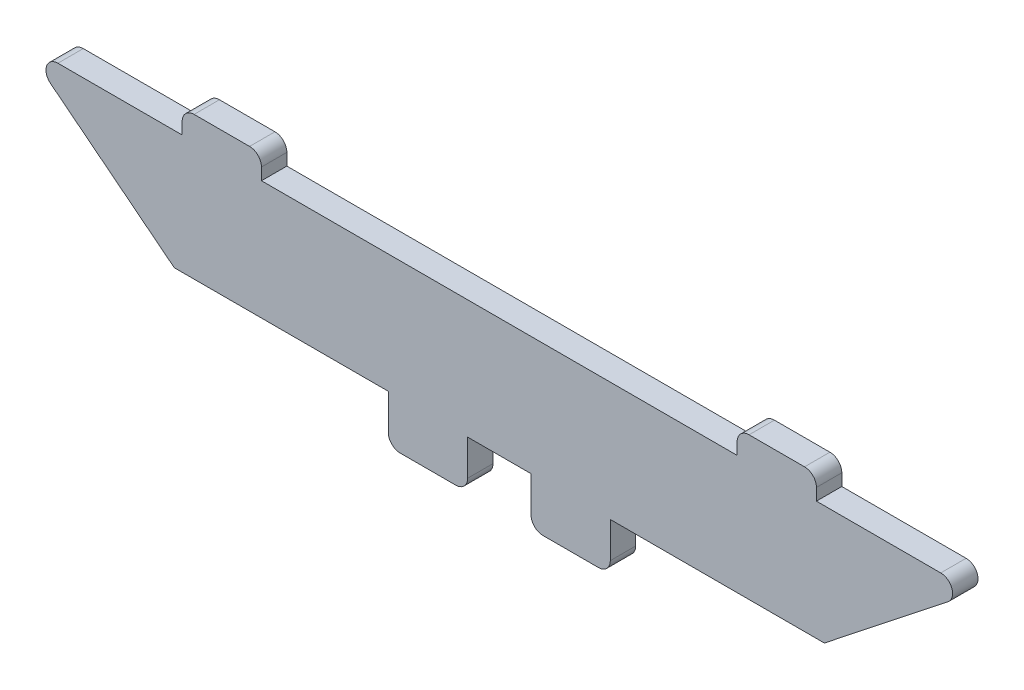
ISO-10303-21;
HEADER;
FILE_DESCRIPTION(('STEP AP214'),'2;1');
FILE_NAME('part.step','',(''),(''),'','','');
FILE_SCHEMA(('AUTOMOTIVE_DESIGN { 1 0 10303 214 1 1 1 1 }'));
ENDSEC;
DATA;
#1=APPLICATION_CONTEXT('core data for automotive mechanical design processes');
#2=APPLICATION_PROTOCOL_DEFINITION('international standard','automotive_design',2000,#1);
#3=PRODUCT_CONTEXT('',#1,'mechanical');
#4=PRODUCT('Part','Part','',(#3));
#5=PRODUCT_RELATED_PRODUCT_CATEGORY('part','',(#4));
#6=PRODUCT_DEFINITION_FORMATION('','',#4);
#7=PRODUCT_DEFINITION_CONTEXT('part definition',#1,'design');
#8=PRODUCT_DEFINITION('design','',#6,#7);
#9=PRODUCT_DEFINITION_SHAPE('','',#8);
#10=(LENGTH_UNIT() NAMED_UNIT(*) SI_UNIT(.MILLI.,.METRE.));
#11=(NAMED_UNIT(*) PLANE_ANGLE_UNIT() SI_UNIT($,.RADIAN.));
#12=(NAMED_UNIT(*) SI_UNIT($,.STERADIAN.) SOLID_ANGLE_UNIT());
#13=UNCERTAINTY_MEASURE_WITH_UNIT(LENGTH_MEASURE(1.E-05),#10,'distance_accuracy_value','');
#14=(GEOMETRIC_REPRESENTATION_CONTEXT(3) GLOBAL_UNCERTAINTY_ASSIGNED_CONTEXT((#13)) GLOBAL_UNIT_ASSIGNED_CONTEXT((#10,
#11,#12)) REPRESENTATION_CONTEXT('',''));
#15=CARTESIAN_POINT('',(0.,0.,0.));
#16=DIRECTION('',(0.,0.,1.));
#17=DIRECTION('',(1.,0.,0.));
#18=AXIS2_PLACEMENT_3D('',#15,#16,#17);
#19=CARTESIAN_POINT('',(-41.,0.,3.2));
#20=DIRECTION('',(0.619644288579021,0.784882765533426,0.));
#21=DIRECTION('',(-0.784882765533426,0.619644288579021,0.));
#22=AXIS2_PLACEMENT_3D('',#19,#20,#21);
#23=PLANE('',#22);
#24=DIRECTION('',(0.784882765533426,-0.619644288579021,0.));
#25=VECTOR('',#24,1.);
#26=CARTESIAN_POINT('',(-41.,0.,3.2));
#27=LINE('',#26,#25);
#28=CARTESIAN_POINT('',(-56.6087227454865,12.3226758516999,3.2));
#29=VERTEX_POINT('',#28);
#30=CARTESIAN_POINT('',(-41.,0.,3.2));
#31=VERTEX_POINT('',#30);
#32=EDGE_CURVE('E228',#29,#31,#27,.T.);
#33=ORIENTED_EDGE('',*,*,#32,.F.);
#34=DIRECTION('',(0.,0.,-1.));
#35=VECTOR('',#34,1.);
#36=CARTESIAN_POINT('',(-56.6087227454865,12.3226758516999,3.2));
#37=LINE('',#36,#35);
#38=CARTESIAN_POINT('',(-56.6087227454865,12.3226758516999,0.));
#39=VERTEX_POINT('',#38);
#40=EDGE_CURVE('E332',#29,#39,#37,.T.);
#41=ORIENTED_EDGE('',*,*,#40,.T.);
#42=DIRECTION('',(0.784882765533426,-0.619644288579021,0.));
#43=VECTOR('',#42,1.);
#44=CARTESIAN_POINT('',(-41.,0.,0.));
#45=LINE('',#44,#43);
#46=CARTESIAN_POINT('',(-41.,0.,0.));
#47=VERTEX_POINT('',#46);
#48=EDGE_CURVE('E253',#39,#47,#45,.T.);
#49=ORIENTED_EDGE('',*,*,#48,.T.);
#50=DIRECTION('',(0.,0.,-1.));
#51=VECTOR('',#50,1.);
#52=CARTESIAN_POINT('',(-41.,0.,3.2));
#53=LINE('',#52,#51);
#54=EDGE_CURVE('E246',#31,#47,#53,.T.);
#55=ORIENTED_EDGE('',*,*,#54,.F.);
#56=EDGE_LOOP('',(#33,#41,#49,#55));
#57=FACE_BOUND('',#56,.T.);
#58=ADVANCED_FACE('F33',(#57),#23,.F.);
#59=CARTESIAN_POINT('',(-41.,0.,3.2));
#60=DIRECTION('',(0.,1.,0.));
#61=DIRECTION('',(0.,0.,1.));
#62=AXIS2_PLACEMENT_3D('',#59,#60,#61);
#63=PLANE('',#62);
#64=DIRECTION('',(1.,0.,0.));
#65=VECTOR('',#64,1.);
#66=CARTESIAN_POINT('',(-41.,0.,0.));
#67=LINE('',#66,#65);
#68=CARTESIAN_POINT('',(-14.,0.,0.));
#69=VERTEX_POINT('',#68);
#70=EDGE_CURVE('E463',#47,#69,#67,.T.);
#71=ORIENTED_EDGE('',*,*,#70,.T.);
#72=DIRECTION('',(0.,0.,-1.));
#73=VECTOR('',#72,1.);
#74=CARTESIAN_POINT('',(-14.,0.,3.2));
#75=LINE('',#74,#73);
#76=CARTESIAN_POINT('',(-14.,0.,3.2));
#77=VERTEX_POINT('',#76);
#78=EDGE_CURVE('E248',#77,#69,#75,.T.);
#79=ORIENTED_EDGE('',*,*,#78,.F.);
#80=DIRECTION('',(1.,0.,0.));
#81=VECTOR('',#80,1.);
#82=CARTESIAN_POINT('',(-41.,0.,3.2));
#83=LINE('',#82,#81);
#84=EDGE_CURVE('E233',#31,#77,#83,.T.);
#85=ORIENTED_EDGE('',*,*,#84,.F.);
#86=ORIENTED_EDGE('',*,*,#54,.T.);
#87=EDGE_LOOP('',(#71,#79,#85,#86));
#88=FACE_BOUND('',#87,.T.);
#89=ADVANCED_FACE('F245',(#88),#63,.F.);
#90=CARTESIAN_POINT('',(-14.,0.,3.2));
#91=DIRECTION('',(1.,0.,0.));
#92=DIRECTION('',(0.,1.,0.));
#93=AXIS2_PLACEMENT_3D('',#90,#91,#92);
#94=PLANE('',#93);
#95=DIRECTION('',(0.,-1.,0.));
#96=VECTOR('',#95,1.);
#97=CARTESIAN_POINT('',(-14.,0.,0.));
#98=LINE('',#97,#96);
#99=CARTESIAN_POINT('',(-14.,-4.5,0.));
#100=VERTEX_POINT('',#99);
#101=EDGE_CURVE('E465',#69,#100,#98,.T.);
#102=ORIENTED_EDGE('',*,*,#101,.T.);
#103=DIRECTION('',(0.,0.,-1.));
#104=VECTOR('',#103,1.);
#105=CARTESIAN_POINT('',(-14.,-4.5,3.2));
#106=LINE('',#105,#104);
#107=CARTESIAN_POINT('',(-14.,-4.5,3.2));
#108=VERTEX_POINT('',#107);
#109=EDGE_CURVE('E330',#100,#108,#106,.F.);
#110=ORIENTED_EDGE('',*,*,#109,.T.);
#111=DIRECTION('',(0.,-1.,0.));
#112=VECTOR('',#111,1.);
#113=CARTESIAN_POINT('',(-14.,0.,3.2));
#114=LINE('',#113,#112);
#115=EDGE_CURVE('E250',#77,#108,#114,.T.);
#116=ORIENTED_EDGE('',*,*,#115,.F.);
#117=ORIENTED_EDGE('',*,*,#78,.T.);
#118=EDGE_LOOP('',(#102,#110,#116,#117));
#119=FACE_BOUND('',#118,.T.);
#120=ADVANCED_FACE('F523',(#119),#94,.F.);
#121=CARTESIAN_POINT('',(-14.,-6.,3.2));
#122=DIRECTION('',(0.,1.,0.));
#123=DIRECTION('',(0.,0.,1.));
#124=AXIS2_PLACEMENT_3D('',#121,#122,#123);
#125=PLANE('',#124);
#126=DIRECTION('',(1.,0.,0.));
#127=VECTOR('',#126,1.);
#128=CARTESIAN_POINT('',(-14.,-6.,0.));
#129=LINE('',#128,#127);
#130=CARTESIAN_POINT('',(-12.5,-6.,0.));
#131=VERTEX_POINT('',#130);
#132=CARTESIAN_POINT('',(-5.5,-6.,0.));
#133=VERTEX_POINT('',#132);
#134=EDGE_CURVE('E420',#131,#133,#129,.T.);
#135=ORIENTED_EDGE('',*,*,#134,.T.);
#136=DIRECTION('',(0.,0.,-1.));
#137=VECTOR('',#136,1.);
#138=CARTESIAN_POINT('',(-5.5,-6.,3.2));
#139=LINE('',#138,#137);
#140=CARTESIAN_POINT('',(-5.5,-6.,3.2));
#141=VERTEX_POINT('',#140);
#142=EDGE_CURVE('E328',#133,#141,#139,.F.);
#143=ORIENTED_EDGE('',*,*,#142,.T.);
#144=DIRECTION('',(1.,0.,0.));
#145=VECTOR('',#144,1.);
#146=CARTESIAN_POINT('',(-14.,-6.,3.2));
#147=LINE('',#146,#145);
#148=CARTESIAN_POINT('',(-12.5,-6.,3.2));
#149=VERTEX_POINT('',#148);
#150=EDGE_CURVE('E480',#149,#141,#147,.T.);
#151=ORIENTED_EDGE('',*,*,#150,.F.);
#152=DIRECTION('',(0.,0.,-1.));
#153=VECTOR('',#152,1.);
#154=CARTESIAN_POINT('',(-12.5,-6.,3.2));
#155=LINE('',#154,#153);
#156=EDGE_CURVE('E325',#149,#131,#155,.T.);
#157=ORIENTED_EDGE('',*,*,#156,.T.);
#158=EDGE_LOOP('',(#135,#143,#151,#157));
#159=FACE_BOUND('',#158,.T.);
#160=ADVANCED_FACE('F471',(#159),#125,.F.);
#161=CARTESIAN_POINT('',(-4.,-6.,3.2));
#162=DIRECTION('',(-1.,0.,0.));
#163=DIRECTION('',(0.,0.,1.));
#164=AXIS2_PLACEMENT_3D('',#161,#162,#163);
#165=PLANE('',#164);
#166=DIRECTION('',(0.,1.,0.));
#167=VECTOR('',#166,1.);
#168=CARTESIAN_POINT('',(-4.,-6.,3.2));
#169=LINE('',#168,#167);
#170=CARTESIAN_POINT('',(-4.,-4.5,3.2));
#171=VERTEX_POINT('',#170);
#172=CARTESIAN_POINT('',(-4.,0.,3.2));
#173=VERTEX_POINT('',#172);
#174=EDGE_CURVE('E479',#171,#173,#169,.T.);
#175=ORIENTED_EDGE('',*,*,#174,.F.);
#176=DIRECTION('',(0.,0.,-1.));
#177=VECTOR('',#176,1.);
#178=CARTESIAN_POINT('',(-4.,-4.5,3.2));
#179=LINE('',#178,#177);
#180=CARTESIAN_POINT('',(-4.,-4.5,0.));
#181=VERTEX_POINT('',#180);
#182=EDGE_CURVE('E322',#171,#181,#179,.T.);
#183=ORIENTED_EDGE('',*,*,#182,.T.);
#184=DIRECTION('',(0.,1.,0.));
#185=VECTOR('',#184,1.);
#186=CARTESIAN_POINT('',(-4.,-6.,0.));
#187=LINE('',#186,#185);
#188=CARTESIAN_POINT('',(-4.,0.,0.));
#189=VERTEX_POINT('',#188);
#190=EDGE_CURVE('E414',#181,#189,#187,.T.);
#191=ORIENTED_EDGE('',*,*,#190,.T.);
#192=DIRECTION('',(0.,0.,-1.));
#193=VECTOR('',#192,1.);
#194=CARTESIAN_POINT('',(-4.,0.,3.2));
#195=LINE('',#194,#193);
#196=EDGE_CURVE('E260',#173,#189,#195,.T.);
#197=ORIENTED_EDGE('',*,*,#196,.F.);
#198=EDGE_LOOP('',(#175,#183,#191,#197));
#199=FACE_BOUND('',#198,.T.);
#200=ADVANCED_FACE('F481',(#199),#165,.F.);
#201=CARTESIAN_POINT('',(-4.,0.,3.2));
#202=DIRECTION('',(0.,1.,0.));
#203=DIRECTION('',(-1.,0.,0.));
#204=AXIS2_PLACEMENT_3D('',#201,#202,#203);
#205=PLANE('',#204);
#206=DIRECTION('',(1.,0.,0.));
#207=VECTOR('',#206,1.);
#208=CARTESIAN_POINT('',(-4.,0.,0.));
#209=LINE('',#208,#207);
#210=CARTESIAN_POINT('',(4.,0.,0.));
#211=VERTEX_POINT('',#210);
#212=EDGE_CURVE('E408',#189,#211,#209,.T.);
#213=ORIENTED_EDGE('',*,*,#212,.T.);
#214=DIRECTION('',(0.,0.,-1.));
#215=VECTOR('',#214,1.);
#216=CARTESIAN_POINT('',(4.,0.,3.2));
#217=LINE('',#216,#215);
#218=CARTESIAN_POINT('',(4.,0.,3.2));
#219=VERTEX_POINT('',#218);
#220=EDGE_CURVE('E399',#219,#211,#217,.T.);
#221=ORIENTED_EDGE('',*,*,#220,.F.);
#222=DIRECTION('',(1.,0.,0.));
#223=VECTOR('',#222,1.);
#224=CARTESIAN_POINT('',(-4.,0.,3.2));
#225=LINE('',#224,#223);
#226=EDGE_CURVE('E409',#173,#219,#225,.T.);
#227=ORIENTED_EDGE('',*,*,#226,.F.);
#228=ORIENTED_EDGE('',*,*,#196,.T.);
#229=EDGE_LOOP('',(#213,#221,#227,#228));
#230=FACE_BOUND('',#229,.T.);
#231=ADVANCED_FACE('F406',(#230),#205,.F.);
#232=CARTESIAN_POINT('',(4.00000000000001,-6.,3.2));
#233=DIRECTION('',(1.,0.,0.));
#234=DIRECTION('',(0.,1.,0.));
#235=AXIS2_PLACEMENT_3D('',#232,#233,#234);
#236=PLANE('',#235);
#237=DIRECTION('',(0.,-1.,0.));
#238=VECTOR('',#237,1.);
#239=CARTESIAN_POINT('',(4.00000000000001,-6.,0.));
#240=LINE('',#239,#238);
#241=CARTESIAN_POINT('',(4.00000000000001,-4.5,0.));
#242=VERTEX_POINT('',#241);
#243=EDGE_CURVE('E416',#211,#242,#240,.T.);
#244=ORIENTED_EDGE('',*,*,#243,.T.);
#245=DIRECTION('',(0.,0.,-1.));
#246=VECTOR('',#245,1.);
#247=CARTESIAN_POINT('',(4.00000000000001,-4.5,3.2));
#248=LINE('',#247,#246);
#249=CARTESIAN_POINT('',(4.00000000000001,-4.5,3.2));
#250=VERTEX_POINT('',#249);
#251=EDGE_CURVE('E320',#242,#250,#248,.F.);
#252=ORIENTED_EDGE('',*,*,#251,.T.);
#253=DIRECTION('',(0.,-1.,0.));
#254=VECTOR('',#253,1.);
#255=CARTESIAN_POINT('',(4.00000000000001,-6.,3.2));
#256=LINE('',#255,#254);
#257=EDGE_CURVE('E483',#219,#250,#256,.T.);
#258=ORIENTED_EDGE('',*,*,#257,.F.);
#259=ORIENTED_EDGE('',*,*,#220,.T.);
#260=EDGE_LOOP('',(#244,#252,#258,#259));
#261=FACE_BOUND('',#260,.T.);
#262=ADVANCED_FACE('F703',(#261),#236,.F.);
#263=CARTESIAN_POINT('',(14.,-6.,3.2));
#264=DIRECTION('',(0.,1.,0.));
#265=DIRECTION('',(-1.,0.,0.));
#266=AXIS2_PLACEMENT_3D('',#263,#264,#265);
#267=PLANE('',#266);
#268=DIRECTION('',(1.,0.,0.));
#269=VECTOR('',#268,1.);
#270=CARTESIAN_POINT('',(14.,-6.,0.));
#271=LINE('',#270,#269);
#272=CARTESIAN_POINT('',(5.50000000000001,-6.,0.));
#273=VERTEX_POINT('',#272);
#274=CARTESIAN_POINT('',(12.5,-6.,0.));
#275=VERTEX_POINT('',#274);
#276=EDGE_CURVE('E418',#273,#275,#271,.T.);
#277=ORIENTED_EDGE('',*,*,#276,.T.);
#278=DIRECTION('',(0.,0.,-1.));
#279=VECTOR('',#278,1.);
#280=CARTESIAN_POINT('',(12.5,-6.,3.2));
#281=LINE('',#280,#279);
#282=CARTESIAN_POINT('',(12.5,-6.,3.2));
#283=VERTEX_POINT('',#282);
#284=EDGE_CURVE('E318',#275,#283,#281,.F.);
#285=ORIENTED_EDGE('',*,*,#284,.T.);
#286=DIRECTION('',(1.,0.,0.));
#287=VECTOR('',#286,1.);
#288=CARTESIAN_POINT('',(14.,-6.,3.2));
#289=LINE('',#288,#287);
#290=CARTESIAN_POINT('',(5.50000000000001,-6.,3.2));
#291=VERTEX_POINT('',#290);
#292=EDGE_CURVE('E490',#291,#283,#289,.T.);
#293=ORIENTED_EDGE('',*,*,#292,.F.);
#294=DIRECTION('',(0.,0.,-1.));
#295=VECTOR('',#294,1.);
#296=CARTESIAN_POINT('',(5.50000000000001,-6.,3.2));
#297=LINE('',#296,#295);
#298=EDGE_CURVE('E315',#291,#273,#297,.T.);
#299=ORIENTED_EDGE('',*,*,#298,.T.);
#300=EDGE_LOOP('',(#277,#285,#293,#299));
#301=FACE_BOUND('',#300,.T.);
#302=ADVANCED_FACE('F501',(#301),#267,.F.);
#303=CARTESIAN_POINT('',(14.,0.,3.2));
#304=DIRECTION('',(-1.,0.,0.));
#305=DIRECTION('',(0.,-1.,0.));
#306=AXIS2_PLACEMENT_3D('',#303,#304,#305);
#307=PLANE('',#306);
#308=DIRECTION('',(0.,1.,0.));
#309=VECTOR('',#308,1.);
#310=CARTESIAN_POINT('',(14.,0.,3.2));
#311=LINE('',#310,#309);
#312=CARTESIAN_POINT('',(14.,-4.5,3.2));
#313=VERTEX_POINT('',#312);
#314=CARTESIAN_POINT('',(14.,0.,3.2));
#315=VERTEX_POINT('',#314);
#316=EDGE_CURVE('E440',#313,#315,#311,.T.);
#317=ORIENTED_EDGE('',*,*,#316,.F.);
#318=DIRECTION('',(0.,0.,-1.));
#319=VECTOR('',#318,1.);
#320=CARTESIAN_POINT('',(14.,-4.5,3.2));
#321=LINE('',#320,#319);
#322=CARTESIAN_POINT('',(14.,-4.5,0.));
#323=VERTEX_POINT('',#322);
#324=EDGE_CURVE('E312',#313,#323,#321,.T.);
#325=ORIENTED_EDGE('',*,*,#324,.T.);
#326=DIRECTION('',(0.,1.,0.));
#327=VECTOR('',#326,1.);
#328=CARTESIAN_POINT('',(14.,0.,0.));
#329=LINE('',#328,#327);
#330=CARTESIAN_POINT('',(14.,0.,0.));
#331=VERTEX_POINT('',#330);
#332=EDGE_CURVE('E426',#323,#331,#329,.T.);
#333=ORIENTED_EDGE('',*,*,#332,.T.);
#334=DIRECTION('',(0.,0.,-1.));
#335=VECTOR('',#334,1.);
#336=CARTESIAN_POINT('',(14.,0.,3.2));
#337=LINE('',#336,#335);
#338=EDGE_CURVE('E396',#315,#331,#337,.T.);
#339=ORIENTED_EDGE('',*,*,#338,.F.);
#340=EDGE_LOOP('',(#317,#325,#333,#339));
#341=FACE_BOUND('',#340,.T.);
#342=ADVANCED_FACE('F496',(#341),#307,.F.);
#343=CARTESIAN_POINT('',(41.,0.,3.2));
#344=DIRECTION('',(0.,1.,0.));
#345=DIRECTION('',(-1.,0.,0.));
#346=AXIS2_PLACEMENT_3D('',#343,#344,#345);
#347=PLANE('',#346);
#348=DIRECTION('',(1.,0.,0.));
#349=VECTOR('',#348,1.);
#350=CARTESIAN_POINT('',(41.,0.,0.));
#351=LINE('',#350,#349);
#352=CARTESIAN_POINT('',(41.,0.,0.));
#353=VERTEX_POINT('',#352);
#354=EDGE_CURVE('E361',#331,#353,#351,.T.);
#355=ORIENTED_EDGE('',*,*,#354,.T.);
#356=DIRECTION('',(0.,0.,-1.));
#357=VECTOR('',#356,1.);
#358=CARTESIAN_POINT('',(41.,0.,3.2));
#359=LINE('',#358,#357);
#360=CARTESIAN_POINT('',(41.,0.,3.2));
#361=VERTEX_POINT('',#360);
#362=EDGE_CURVE('E393',#361,#353,#359,.T.);
#363=ORIENTED_EDGE('',*,*,#362,.F.);
#364=DIRECTION('',(1.,0.,0.));
#365=VECTOR('',#364,1.);
#366=CARTESIAN_POINT('',(41.,0.,3.2));
#367=LINE('',#366,#365);
#368=EDGE_CURVE('E436',#315,#361,#367,.T.);
#369=ORIENTED_EDGE('',*,*,#368,.F.);
#370=ORIENTED_EDGE('',*,*,#338,.T.);
#371=EDGE_LOOP('',(#355,#363,#369,#370));
#372=FACE_BOUND('',#371,.T.);
#373=ADVANCED_FACE('F430',(#372),#347,.F.);
#374=CARTESIAN_POINT('',(41.,0.,3.2));
#375=DIRECTION('',(-0.619644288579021,0.784882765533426,0.));
#376=DIRECTION('',(-0.784882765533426,-0.619644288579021,0.));
#377=AXIS2_PLACEMENT_3D('',#374,#375,#376);
#378=PLANE('',#377);
#379=DIRECTION('',(0.784882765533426,0.619644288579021,0.));
#380=VECTOR('',#379,1.);
#381=CARTESIAN_POINT('',(41.,0.,0.));
#382=LINE('',#381,#380);
#383=CARTESIAN_POINT('',(56.6087227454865,12.3226758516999,0.));
#384=VERTEX_POINT('',#383);
#385=EDGE_CURVE('E357',#353,#384,#382,.T.);
#386=ORIENTED_EDGE('',*,*,#385,.T.);
#387=DIRECTION('',(0.,0.,-1.));
#388=VECTOR('',#387,1.);
#389=CARTESIAN_POINT('',(56.6087227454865,12.3226758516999,3.2));
#390=LINE('',#389,#388);
#391=CARTESIAN_POINT('',(56.6087227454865,12.3226758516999,3.2));
#392=VERTEX_POINT('',#391);
#393=EDGE_CURVE('E11',#384,#392,#390,.F.);
#394=ORIENTED_EDGE('',*,*,#393,.T.);
#395=DIRECTION('',(0.784882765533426,0.619644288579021,0.));
#396=VECTOR('',#395,1.);
#397=CARTESIAN_POINT('',(41.,0.,3.2));
#398=LINE('',#397,#396);
#399=EDGE_CURVE('E435',#361,#392,#398,.T.);
#400=ORIENTED_EDGE('',*,*,#399,.F.);
#401=ORIENTED_EDGE('',*,*,#362,.T.);
#402=EDGE_LOOP('',(#386,#394,#400,#401));
#403=FACE_BOUND('',#402,.T.);
#404=ADVANCED_FACE('F434',(#403),#378,.F.);
#405=CARTESIAN_POINT('',(60.,15.,3.2));
#406=DIRECTION('',(0.,-1.,0.));
#407=DIRECTION('',(1.,0.,0.));
#408=AXIS2_PLACEMENT_3D('',#405,#406,#407);
#409=PLANE('',#408);
#410=DIRECTION('',(-1.,0.,0.));
#411=VECTOR('',#410,1.);
#412=CARTESIAN_POINT('',(60.,15.,3.2));
#413=LINE('',#412,#411);
#414=CARTESIAN_POINT('',(55.679256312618,15.,3.2));
#415=VERTEX_POINT('',#414);
#416=CARTESIAN_POINT('',(40.,15.,3.2));
#417=VERTEX_POINT('',#416);
#418=EDGE_CURVE('E349',#415,#417,#413,.T.);
#419=ORIENTED_EDGE('',*,*,#418,.F.);
#420=DIRECTION('',(0.,0.,-1.));
#421=VECTOR('',#420,1.);
#422=CARTESIAN_POINT('',(55.679256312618,15.,3.2));
#423=LINE('',#422,#421);
#424=CARTESIAN_POINT('',(55.679256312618,15.,0.));
#425=VERTEX_POINT('',#424);
#426=EDGE_CURVE('E41',#415,#425,#423,.T.);
#427=ORIENTED_EDGE('',*,*,#426,.T.);
#428=DIRECTION('',(-1.,0.,0.));
#429=VECTOR('',#428,1.);
#430=CARTESIAN_POINT('',(60.,15.,0.));
#431=LINE('',#430,#429);
#432=CARTESIAN_POINT('',(40.,15.,0.));
#433=VERTEX_POINT('',#432);
#434=EDGE_CURVE('E347',#425,#433,#431,.T.);
#435=ORIENTED_EDGE('',*,*,#434,.T.);
#436=DIRECTION('',(0.,0.,-1.));
#437=VECTOR('',#436,1.);
#438=CARTESIAN_POINT('',(40.,15.,3.2));
#439=LINE('',#438,#437);
#440=EDGE_CURVE('E391',#417,#433,#439,.T.);
#441=ORIENTED_EDGE('',*,*,#440,.F.);
#442=EDGE_LOOP('',(#419,#427,#435,#441));
#443=FACE_BOUND('',#442,.T.);
#444=ADVANCED_FACE('F345',(#443),#409,.F.);
#445=CARTESIAN_POINT('',(40.,15.,3.2));
#446=DIRECTION('',(-1.,0.,0.));
#447=DIRECTION('',(0.,0.,1.));
#448=AXIS2_PLACEMENT_3D('',#445,#446,#447);
#449=PLANE('',#448);
#450=DIRECTION('',(0.,1.,0.));
#451=VECTOR('',#450,1.);
#452=CARTESIAN_POINT('',(40.,15.,0.));
#453=LINE('',#452,#451);
#454=CARTESIAN_POINT('',(40.,16.5,0.));
#455=VERTEX_POINT('',#454);
#456=EDGE_CURVE('E356',#433,#455,#453,.T.);
#457=ORIENTED_EDGE('',*,*,#456,.T.);
#458=DIRECTION('',(0.,0.,-1.));
#459=VECTOR('',#458,1.);
#460=CARTESIAN_POINT('',(40.,16.5,3.2));
#461=LINE('',#460,#459);
#462=CARTESIAN_POINT('',(40.,16.5,3.2));
#463=VERTEX_POINT('',#462);
#464=EDGE_CURVE('E310',#455,#463,#461,.F.);
#465=ORIENTED_EDGE('',*,*,#464,.T.);
#466=DIRECTION('',(0.,1.,0.));
#467=VECTOR('',#466,1.);
#468=CARTESIAN_POINT('',(40.,15.,3.2));
#469=LINE('',#468,#467);
#470=EDGE_CURVE('E438',#417,#463,#469,.T.);
#471=ORIENTED_EDGE('',*,*,#470,.F.);
#472=ORIENTED_EDGE('',*,*,#440,.T.);
#473=EDGE_LOOP('',(#457,#465,#471,#472));
#474=FACE_BOUND('',#473,.T.);
#475=ADVANCED_FACE('F672',(#474),#449,.F.);
#476=CARTESIAN_POINT('',(40.,18.,3.2));
#477=DIRECTION('',(0.,-1.,0.));
#478=DIRECTION('',(1.,0.,0.));
#479=AXIS2_PLACEMENT_3D('',#476,#477,#478);
#480=PLANE('',#479);
#481=DIRECTION('',(-1.,0.,0.));
#482=VECTOR('',#481,1.);
#483=CARTESIAN_POINT('',(40.,18.,0.));
#484=LINE('',#483,#482);
#485=CARTESIAN_POINT('',(38.5,18.,0.));
#486=VERTEX_POINT('',#485);
#487=CARTESIAN_POINT('',(31.5,18.,0.));
#488=VERTEX_POINT('',#487);
#489=EDGE_CURVE('E359',#486,#488,#484,.T.);
#490=ORIENTED_EDGE('',*,*,#489,.T.);
#491=DIRECTION('',(0.,0.,-1.));
#492=VECTOR('',#491,1.);
#493=CARTESIAN_POINT('',(31.5,18.,3.2));
#494=LINE('',#493,#492);
#495=CARTESIAN_POINT('',(31.5,18.,3.2));
#496=VERTEX_POINT('',#495);
#497=EDGE_CURVE('E308',#488,#496,#494,.F.);
#498=ORIENTED_EDGE('',*,*,#497,.T.);
#499=DIRECTION('',(-1.,0.,0.));
#500=VECTOR('',#499,1.);
#501=CARTESIAN_POINT('',(40.,18.,3.2));
#502=LINE('',#501,#500);
#503=CARTESIAN_POINT('',(38.5,18.,3.2));
#504=VERTEX_POINT('',#503);
#505=EDGE_CURVE('E446',#504,#496,#502,.T.);
#506=ORIENTED_EDGE('',*,*,#505,.F.);
#507=DIRECTION('',(0.,0.,-1.));
#508=VECTOR('',#507,1.);
#509=CARTESIAN_POINT('',(38.5,18.,3.2));
#510=LINE('',#509,#508);
#511=EDGE_CURVE('E305',#504,#486,#510,.T.);
#512=ORIENTED_EDGE('',*,*,#511,.T.);
#513=EDGE_LOOP('',(#490,#498,#506,#512));
#514=FACE_BOUND('',#513,.T.);
#515=ADVANCED_FACE('F663',(#514),#480,.F.);
#516=CARTESIAN_POINT('',(30.,18.,3.2));
#517=DIRECTION('',(1.,0.,0.));
#518=DIRECTION('',(0.,0.,-1.));
#519=AXIS2_PLACEMENT_3D('',#516,#517,#518);
#520=PLANE('',#519);
#521=DIRECTION('',(0.,-1.,0.));
#522=VECTOR('',#521,1.);
#523=CARTESIAN_POINT('',(30.,18.,3.2));
#524=LINE('',#523,#522);
#525=CARTESIAN_POINT('',(30.,16.5,3.2));
#526=VERTEX_POINT('',#525);
#527=CARTESIAN_POINT('',(30.,15.,3.2));
#528=VERTEX_POINT('',#527);
#529=EDGE_CURVE('E449',#526,#528,#524,.T.);
#530=ORIENTED_EDGE('',*,*,#529,.F.);
#531=DIRECTION('',(0.,0.,-1.));
#532=VECTOR('',#531,1.);
#533=CARTESIAN_POINT('',(30.,16.5,3.2));
#534=LINE('',#533,#532);
#535=CARTESIAN_POINT('',(30.,16.5,0.));
#536=VERTEX_POINT('',#535);
#537=EDGE_CURVE('E302',#526,#536,#534,.T.);
#538=ORIENTED_EDGE('',*,*,#537,.T.);
#539=DIRECTION('',(0.,-1.,0.));
#540=VECTOR('',#539,1.);
#541=CARTESIAN_POINT('',(30.,18.,0.));
#542=LINE('',#541,#540);
#543=CARTESIAN_POINT('',(30.,15.,0.));
#544=VERTEX_POINT('',#543);
#545=EDGE_CURVE('E367',#536,#544,#542,.T.);
#546=ORIENTED_EDGE('',*,*,#545,.T.);
#547=DIRECTION('',(0.,0.,-1.));
#548=VECTOR('',#547,1.);
#549=CARTESIAN_POINT('',(30.,15.,3.2));
#550=LINE('',#549,#548);
#551=EDGE_CURVE('E388',#528,#544,#550,.T.);
#552=ORIENTED_EDGE('',*,*,#551,.F.);
#553=EDGE_LOOP('',(#530,#538,#546,#552));
#554=FACE_BOUND('',#553,.T.);
#555=ADVANCED_FACE('F546',(#554),#520,.F.);
#556=CARTESIAN_POINT('',(-30.,15.,3.2));
#557=DIRECTION('',(0.,-1.,0.));
#558=DIRECTION('',(1.,0.,0.));
#559=AXIS2_PLACEMENT_3D('',#556,#557,#558);
#560=PLANE('',#559);
#561=DIRECTION('',(-1.,0.,0.));
#562=VECTOR('',#561,1.);
#563=CARTESIAN_POINT('',(-30.,15.,0.));
#564=LINE('',#563,#562);
#565=CARTESIAN_POINT('',(-30.,15.,0.));
#566=VERTEX_POINT('',#565);
#567=EDGE_CURVE('E369',#544,#566,#564,.T.);
#568=ORIENTED_EDGE('',*,*,#567,.T.);
#569=DIRECTION('',(0.,0.,-1.));
#570=VECTOR('',#569,1.);
#571=CARTESIAN_POINT('',(-30.,15.,3.2));
#572=LINE('',#571,#570);
#573=CARTESIAN_POINT('',(-30.,15.,3.2));
#574=VERTEX_POINT('',#573);
#575=EDGE_CURVE('E384',#574,#566,#572,.T.);
#576=ORIENTED_EDGE('',*,*,#575,.F.);
#577=DIRECTION('',(-1.,0.,0.));
#578=VECTOR('',#577,1.);
#579=CARTESIAN_POINT('',(-30.,15.,3.2));
#580=LINE('',#579,#578);
#581=EDGE_CURVE('E451',#528,#574,#580,.T.);
#582=ORIENTED_EDGE('',*,*,#581,.F.);
#583=ORIENTED_EDGE('',*,*,#551,.T.);
#584=EDGE_LOOP('',(#568,#576,#582,#583));
#585=FACE_BOUND('',#584,.T.);
#586=ADVANCED_FACE('F552',(#585),#560,.F.);
#587=CARTESIAN_POINT('',(-30.,18.,3.2));
#588=DIRECTION('',(-1.,0.,0.));
#589=DIRECTION('',(0.,0.,1.));
#590=AXIS2_PLACEMENT_3D('',#587,#588,#589);
#591=PLANE('',#590);
#592=DIRECTION('',(0.,1.,0.));
#593=VECTOR('',#592,1.);
#594=CARTESIAN_POINT('',(-30.,18.,0.));
#595=LINE('',#594,#593);
#596=CARTESIAN_POINT('',(-30.,16.5,0.));
#597=VERTEX_POINT('',#596);
#598=EDGE_CURVE('E371',#566,#597,#595,.T.);
#599=ORIENTED_EDGE('',*,*,#598,.T.);
#600=DIRECTION('',(0.,0.,-1.));
#601=VECTOR('',#600,1.);
#602=CARTESIAN_POINT('',(-30.,16.5,3.2));
#603=LINE('',#602,#601);
#604=CARTESIAN_POINT('',(-30.,16.5,3.2));
#605=VERTEX_POINT('',#604);
#606=EDGE_CURVE('E300',#597,#605,#603,.F.);
#607=ORIENTED_EDGE('',*,*,#606,.T.);
#608=DIRECTION('',(0.,1.,0.));
#609=VECTOR('',#608,1.);
#610=CARTESIAN_POINT('',(-30.,18.,3.2));
#611=LINE('',#610,#609);
#612=EDGE_CURVE('E453',#574,#605,#611,.T.);
#613=ORIENTED_EDGE('',*,*,#612,.F.);
#614=ORIENTED_EDGE('',*,*,#575,.T.);
#615=EDGE_LOOP('',(#599,#607,#613,#614));
#616=FACE_BOUND('',#615,.T.);
#617=ADVANCED_FACE('F644',(#616),#591,.F.);
#618=CARTESIAN_POINT('',(-40.,18.,3.2));
#619=DIRECTION('',(0.,-1.,0.));
#620=DIRECTION('',(0.,0.,-1.));
#621=AXIS2_PLACEMENT_3D('',#618,#619,#620);
#622=PLANE('',#621);
#623=DIRECTION('',(-1.,0.,0.));
#624=VECTOR('',#623,1.);
#625=CARTESIAN_POINT('',(-40.,18.,0.));
#626=LINE('',#625,#624);
#627=CARTESIAN_POINT('',(-31.5,18.,0.));
#628=VERTEX_POINT('',#627);
#629=CARTESIAN_POINT('',(-38.5,18.,0.));
#630=VERTEX_POINT('',#629);
#631=EDGE_CURVE('E374',#628,#630,#626,.T.);
#632=ORIENTED_EDGE('',*,*,#631,.T.);
#633=DIRECTION('',(0.,0.,-1.));
#634=VECTOR('',#633,1.);
#635=CARTESIAN_POINT('',(-38.5,18.,3.2));
#636=LINE('',#635,#634);
#637=CARTESIAN_POINT('',(-38.5,18.,3.2));
#638=VERTEX_POINT('',#637);
#639=EDGE_CURVE('E282',#630,#638,#636,.F.);
#640=ORIENTED_EDGE('',*,*,#639,.T.);
#641=DIRECTION('',(-1.,0.,0.));
#642=VECTOR('',#641,1.);
#643=CARTESIAN_POINT('',(-40.,18.,3.2));
#644=LINE('',#643,#642);
#645=CARTESIAN_POINT('',(-31.5,18.,3.2));
#646=VERTEX_POINT('',#645);
#647=EDGE_CURVE('E456',#646,#638,#644,.T.);
#648=ORIENTED_EDGE('',*,*,#647,.F.);
#649=DIRECTION('',(0.,0.,-1.));
#650=VECTOR('',#649,1.);
#651=CARTESIAN_POINT('',(-31.5,18.,3.2));
#652=LINE('',#651,#650);
#653=EDGE_CURVE('E279',#646,#628,#652,.T.);
#654=ORIENTED_EDGE('',*,*,#653,.T.);
#655=EDGE_LOOP('',(#632,#640,#648,#654));
#656=FACE_BOUND('',#655,.T.);
#657=ADVANCED_FACE('F561',(#656),#622,.F.);
#658=CARTESIAN_POINT('',(-40.,15.,3.2));
#659=DIRECTION('',(1.,0.,0.));
#660=DIRECTION('',(0.,0.,-1.));
#661=AXIS2_PLACEMENT_3D('',#658,#659,#660);
#662=PLANE('',#661);
#663=DIRECTION('',(0.,-1.,0.));
#664=VECTOR('',#663,1.);
#665=CARTESIAN_POINT('',(-40.,15.,3.2));
#666=LINE('',#665,#664);
#667=CARTESIAN_POINT('',(-40.,16.5,3.2));
#668=VERTEX_POINT('',#667);
#669=CARTESIAN_POINT('',(-40.,15.,3.2));
#670=VERTEX_POINT('',#669);
#671=EDGE_CURVE('E459',#668,#670,#666,.T.);
#672=ORIENTED_EDGE('',*,*,#671,.F.);
#673=DIRECTION('',(0.,0.,-1.));
#674=VECTOR('',#673,1.);
#675=CARTESIAN_POINT('',(-40.,16.5,3.2));
#676=LINE('',#675,#674);
#677=CARTESIAN_POINT('',(-40.,16.5,0.));
#678=VERTEX_POINT('',#677);
#679=EDGE_CURVE('E255',#668,#678,#676,.T.);
#680=ORIENTED_EDGE('',*,*,#679,.T.);
#681=DIRECTION('',(0.,-1.,0.));
#682=VECTOR('',#681,1.);
#683=CARTESIAN_POINT('',(-40.,15.,0.));
#684=LINE('',#683,#682);
#685=CARTESIAN_POINT('',(-40.,15.,0.));
#686=VERTEX_POINT('',#685);
#687=EDGE_CURVE('E377',#678,#686,#684,.T.);
#688=ORIENTED_EDGE('',*,*,#687,.T.);
#689=DIRECTION('',(0.,0.,-1.));
#690=VECTOR('',#689,1.);
#691=CARTESIAN_POINT('',(-40.,15.,3.2));
#692=LINE('',#691,#690);
#693=EDGE_CURVE('E381',#670,#686,#692,.T.);
#694=ORIENTED_EDGE('',*,*,#693,.F.);
#695=EDGE_LOOP('',(#672,#680,#688,#694));
#696=FACE_BOUND('',#695,.T.);
#697=ADVANCED_FACE('F570',(#696),#662,.F.);
#698=CARTESIAN_POINT('',(-60.,15.,3.2));
#699=DIRECTION('',(0.,-1.,0.));
#700=DIRECTION('',(0.,0.,-1.));
#701=AXIS2_PLACEMENT_3D('',#698,#699,#700);
#702=PLANE('',#701);
#703=DIRECTION('',(-1.,0.,0.));
#704=VECTOR('',#703,1.);
#705=CARTESIAN_POINT('',(-60.,15.,0.));
#706=LINE('',#705,#704);
#707=CARTESIAN_POINT('',(-55.679256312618,15.,0.));
#708=VERTEX_POINT('',#707);
#709=EDGE_CURVE('E241',#686,#708,#706,.T.);
#710=ORIENTED_EDGE('',*,*,#709,.T.);
#711=DIRECTION('',(0.,0.,-1.));
#712=VECTOR('',#711,1.);
#713=CARTESIAN_POINT('',(-55.679256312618,15.,3.2));
#714=LINE('',#713,#712);
#715=CARTESIAN_POINT('',(-55.679256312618,15.,3.2));
#716=VERTEX_POINT('',#715);
#717=EDGE_CURVE('E338',#708,#716,#714,.F.);
#718=ORIENTED_EDGE('',*,*,#717,.T.);
#719=DIRECTION('',(-1.,0.,0.));
#720=VECTOR('',#719,1.);
#721=CARTESIAN_POINT('',(-60.,15.,3.2));
#722=LINE('',#721,#720);
#723=EDGE_CURVE('E385',#670,#716,#722,.T.);
#724=ORIENTED_EDGE('',*,*,#723,.F.);
#725=ORIENTED_EDGE('',*,*,#693,.T.);
#726=EDGE_LOOP('',(#710,#718,#724,#725));
#727=FACE_BOUND('',#726,.T.);
#728=ADVANCED_FACE('F633',(#727),#702,.F.);
#729=CARTESIAN_POINT('',(0.,0.,3.2));
#730=DIRECTION('',(0.,0.,-1.));
#731=DIRECTION('',(-1.,0.,0.));
#732=AXIS2_PLACEMENT_3D('',#729,#730,#731);
#733=PLANE('',#732);
#734=ORIENTED_EDGE('',*,*,#723,.T.);
#735=CARTESIAN_POINT('',(-55.679256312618,13.5,3.2));
#736=DIRECTION('',(0.,0.,-1.));
#737=DIRECTION('',(-1.,0.,0.));
#738=AXIS2_PLACEMENT_3D('',#735,#736,#737);
#739=CIRCLE('',#738,1.5);
#740=EDGE_CURVE('E236',#716,#29,#739,.F.);
#741=ORIENTED_EDGE('',*,*,#740,.T.);
#742=ORIENTED_EDGE('',*,*,#32,.T.);
#743=ORIENTED_EDGE('',*,*,#84,.T.);
#744=ORIENTED_EDGE('',*,*,#115,.T.);
#745=CARTESIAN_POINT('',(-12.5,-4.5,3.2));
#746=DIRECTION('',(0.,0.,-1.));
#747=DIRECTION('',(-1.,0.,0.));
#748=AXIS2_PLACEMENT_3D('',#745,#746,#747);
#749=CIRCLE('',#748,1.5);
#750=EDGE_CURVE('E284',#108,#149,#749,.F.);
#751=ORIENTED_EDGE('',*,*,#750,.T.);
#752=ORIENTED_EDGE('',*,*,#150,.T.);
#753=CARTESIAN_POINT('',(-5.5,-4.5,3.2));
#754=DIRECTION('',(0.,0.,-1.));
#755=DIRECTION('',(-1.,0.,0.));
#756=AXIS2_PLACEMENT_3D('',#753,#754,#755);
#757=CIRCLE('',#756,1.5);
#758=EDGE_CURVE('E286',#141,#171,#757,.F.);
#759=ORIENTED_EDGE('',*,*,#758,.T.);
#760=ORIENTED_EDGE('',*,*,#174,.T.);
#761=ORIENTED_EDGE('',*,*,#226,.T.);
#762=ORIENTED_EDGE('',*,*,#257,.T.);
#763=CARTESIAN_POINT('',(5.50000000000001,-4.5,3.2));
#764=DIRECTION('',(0.,0.,-1.));
#765=DIRECTION('',(-1.,0.,0.));
#766=AXIS2_PLACEMENT_3D('',#763,#764,#765);
#767=CIRCLE('',#766,1.5);
#768=EDGE_CURVE('E288',#250,#291,#767,.F.);
#769=ORIENTED_EDGE('',*,*,#768,.T.);
#770=ORIENTED_EDGE('',*,*,#292,.T.);
#771=CARTESIAN_POINT('',(12.5,-4.5,3.2));
#772=DIRECTION('',(0.,0.,-1.));
#773=DIRECTION('',(-1.,0.,0.));
#774=AXIS2_PLACEMENT_3D('',#771,#772,#773);
#775=CIRCLE('',#774,1.5);
#776=EDGE_CURVE('E290',#283,#313,#775,.F.);
#777=ORIENTED_EDGE('',*,*,#776,.T.);
#778=ORIENTED_EDGE('',*,*,#316,.T.);
#779=ORIENTED_EDGE('',*,*,#368,.T.);
#780=ORIENTED_EDGE('',*,*,#399,.T.);
#781=CARTESIAN_POINT('',(55.679256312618,13.5,3.2));
#782=DIRECTION('',(0.,0.,-1.));
#783=DIRECTION('',(-1.,0.,0.));
#784=AXIS2_PLACEMENT_3D('',#781,#782,#783);
#785=CIRCLE('',#784,1.5);
#786=EDGE_CURVE('E48',#392,#415,#785,.F.);
#787=ORIENTED_EDGE('',*,*,#786,.T.);
#788=ORIENTED_EDGE('',*,*,#418,.T.);
#789=ORIENTED_EDGE('',*,*,#470,.T.);
#790=CARTESIAN_POINT('',(38.5,16.5,3.2));
#791=DIRECTION('',(0.,0.,-1.));
#792=DIRECTION('',(-1.,0.,0.));
#793=AXIS2_PLACEMENT_3D('',#790,#791,#792);
#794=CIRCLE('',#793,1.5);
#795=EDGE_CURVE('E292',#463,#504,#794,.F.);
#796=ORIENTED_EDGE('',*,*,#795,.T.);
#797=ORIENTED_EDGE('',*,*,#505,.T.);
#798=CARTESIAN_POINT('',(31.5,16.5,3.2));
#799=DIRECTION('',(0.,0.,-1.));
#800=DIRECTION('',(-1.,0.,0.));
#801=AXIS2_PLACEMENT_3D('',#798,#799,#800);
#802=CIRCLE('',#801,1.5);
#803=EDGE_CURVE('E294',#496,#526,#802,.F.);
#804=ORIENTED_EDGE('',*,*,#803,.T.);
#805=ORIENTED_EDGE('',*,*,#529,.T.);
#806=ORIENTED_EDGE('',*,*,#581,.T.);
#807=ORIENTED_EDGE('',*,*,#612,.T.);
#808=CARTESIAN_POINT('',(-31.5,16.5,3.2));
#809=DIRECTION('',(0.,0.,-1.));
#810=DIRECTION('',(-1.,0.,0.));
#811=AXIS2_PLACEMENT_3D('',#808,#809,#810);
#812=CIRCLE('',#811,1.5);
#813=EDGE_CURVE('E296',#605,#646,#812,.F.);
#814=ORIENTED_EDGE('',*,*,#813,.T.);
#815=ORIENTED_EDGE('',*,*,#647,.T.);
#816=CARTESIAN_POINT('',(-38.5,16.5,3.2));
#817=DIRECTION('',(0.,0.,-1.));
#818=DIRECTION('',(-1.,0.,0.));
#819=AXIS2_PLACEMENT_3D('',#816,#817,#818);
#820=CIRCLE('',#819,1.5);
#821=EDGE_CURVE('E298',#638,#668,#820,.F.);
#822=ORIENTED_EDGE('',*,*,#821,.T.);
#823=ORIENTED_EDGE('',*,*,#671,.T.);
#824=EDGE_LOOP('',(#734,#741,#742,#743,#744,#751,#752,#759,#760,#761,#762,#769,#770,#777,#778,
#779,#780,#787,#788,#789,#796,#797,#804,#805,#806,#807,#814,#815,#822,#823));
#825=FACE_BOUND('',#824,.T.);
#826=ADVANCED_FACE('F231',(#825),#733,.F.);
#827=CARTESIAN_POINT('',(0.,0.,0.));
#828=DIRECTION('',(0.,0.,-1.));
#829=DIRECTION('',(-1.,0.,0.));
#830=AXIS2_PLACEMENT_3D('',#827,#828,#829);
#831=PLANE('',#830);
#832=ORIENTED_EDGE('',*,*,#48,.F.);
#833=CARTESIAN_POINT('',(-55.679256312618,13.5,0.));
#834=DIRECTION('',(0.,0.,-1.));
#835=DIRECTION('',(-1.,0.,0.));
#836=AXIS2_PLACEMENT_3D('',#833,#834,#835);
#837=CIRCLE('',#836,1.5);
#838=EDGE_CURVE('E336',#39,#708,#837,.T.);
#839=ORIENTED_EDGE('',*,*,#838,.T.);
#840=ORIENTED_EDGE('',*,*,#709,.F.);
#841=ORIENTED_EDGE('',*,*,#687,.F.);
#842=CARTESIAN_POINT('',(-38.5,16.5,0.));
#843=DIRECTION('',(0.,0.,-1.));
#844=DIRECTION('',(-1.,0.,0.));
#845=AXIS2_PLACEMENT_3D('',#842,#843,#844);
#846=CIRCLE('',#845,1.5);
#847=EDGE_CURVE('E277',#678,#630,#846,.T.);
#848=ORIENTED_EDGE('',*,*,#847,.T.);
#849=ORIENTED_EDGE('',*,*,#631,.F.);
#850=CARTESIAN_POINT('',(-31.5,16.5,0.));
#851=DIRECTION('',(0.,0.,-1.));
#852=DIRECTION('',(-1.,0.,0.));
#853=AXIS2_PLACEMENT_3D('',#850,#851,#852);
#854=CIRCLE('',#853,1.5);
#855=EDGE_CURVE('E275',#628,#597,#854,.T.);
#856=ORIENTED_EDGE('',*,*,#855,.T.);
#857=ORIENTED_EDGE('',*,*,#598,.F.);
#858=ORIENTED_EDGE('',*,*,#567,.F.);
#859=ORIENTED_EDGE('',*,*,#545,.F.);
#860=CARTESIAN_POINT('',(31.5,16.5,0.));
#861=DIRECTION('',(0.,0.,-1.));
#862=DIRECTION('',(-1.,0.,0.));
#863=AXIS2_PLACEMENT_3D('',#860,#861,#862);
#864=CIRCLE('',#863,1.5);
#865=EDGE_CURVE('E273',#536,#488,#864,.T.);
#866=ORIENTED_EDGE('',*,*,#865,.T.);
#867=ORIENTED_EDGE('',*,*,#489,.F.);
#868=CARTESIAN_POINT('',(38.5,16.5,0.));
#869=DIRECTION('',(0.,0.,-1.));
#870=DIRECTION('',(-1.,0.,0.));
#871=AXIS2_PLACEMENT_3D('',#868,#869,#870);
#872=CIRCLE('',#871,1.5);
#873=EDGE_CURVE('E271',#486,#455,#872,.T.);
#874=ORIENTED_EDGE('',*,*,#873,.T.);
#875=ORIENTED_EDGE('',*,*,#456,.F.);
#876=ORIENTED_EDGE('',*,*,#434,.F.);
#877=CARTESIAN_POINT('',(55.679256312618,13.5,0.));
#878=DIRECTION('',(0.,0.,-1.));
#879=DIRECTION('',(-1.,0.,0.));
#880=AXIS2_PLACEMENT_3D('',#877,#878,#879);
#881=CIRCLE('',#880,1.5);
#882=EDGE_CURVE('E334',#425,#384,#881,.T.);
#883=ORIENTED_EDGE('',*,*,#882,.T.);
#884=ORIENTED_EDGE('',*,*,#385,.F.);
#885=ORIENTED_EDGE('',*,*,#354,.F.);
#886=ORIENTED_EDGE('',*,*,#332,.F.);
#887=CARTESIAN_POINT('',(12.5,-4.5,0.));
#888=DIRECTION('',(0.,0.,-1.));
#889=DIRECTION('',(-1.,0.,0.));
#890=AXIS2_PLACEMENT_3D('',#887,#888,#889);
#891=CIRCLE('',#890,1.5);
#892=EDGE_CURVE('E269',#323,#275,#891,.T.);
#893=ORIENTED_EDGE('',*,*,#892,.T.);
#894=ORIENTED_EDGE('',*,*,#276,.F.);
#895=CARTESIAN_POINT('',(5.50000000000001,-4.5,0.));
#896=DIRECTION('',(0.,0.,-1.));
#897=DIRECTION('',(-1.,0.,0.));
#898=AXIS2_PLACEMENT_3D('',#895,#896,#897);
#899=CIRCLE('',#898,1.5);
#900=EDGE_CURVE('E267',#273,#242,#899,.T.);
#901=ORIENTED_EDGE('',*,*,#900,.T.);
#902=ORIENTED_EDGE('',*,*,#243,.F.);
#903=ORIENTED_EDGE('',*,*,#212,.F.);
#904=ORIENTED_EDGE('',*,*,#190,.F.);
#905=CARTESIAN_POINT('',(-5.5,-4.5,0.));
#906=DIRECTION('',(0.,0.,-1.));
#907=DIRECTION('',(-1.,0.,0.));
#908=AXIS2_PLACEMENT_3D('',#905,#906,#907);
#909=CIRCLE('',#908,1.5);
#910=EDGE_CURVE('E265',#181,#133,#909,.T.);
#911=ORIENTED_EDGE('',*,*,#910,.T.);
#912=ORIENTED_EDGE('',*,*,#134,.F.);
#913=CARTESIAN_POINT('',(-12.5,-4.5,0.));
#914=DIRECTION('',(0.,0.,-1.));
#915=DIRECTION('',(-1.,0.,0.));
#916=AXIS2_PLACEMENT_3D('',#913,#914,#915);
#917=CIRCLE('',#916,1.5);
#918=EDGE_CURVE('E258',#131,#100,#917,.T.);
#919=ORIENTED_EDGE('',*,*,#918,.T.);
#920=ORIENTED_EDGE('',*,*,#101,.F.);
#921=ORIENTED_EDGE('',*,*,#70,.F.);
#922=EDGE_LOOP('',(#832,#839,#840,#841,#848,#849,#856,#857,#858,#859,#866,#867,#874,#875,#876,
#883,#884,#885,#886,#893,#894,#901,#902,#903,#904,#911,#912,#919,#920,#921));
#923=FACE_BOUND('',#922,.T.);
#924=ADVANCED_FACE('F353',(#923),#831,.T.);
#925=CARTESIAN_POINT('',(-38.5,16.5,3.2));
#926=DIRECTION('',(0.,0.,-1.));
#927=DIRECTION('',(-1.,0.,0.));
#928=AXIS2_PLACEMENT_3D('',#925,#926,#927);
#929=CYLINDRICAL_SURFACE('',#928,1.5);
#930=ORIENTED_EDGE('',*,*,#821,.F.);
#931=ORIENTED_EDGE('',*,*,#639,.F.);
#932=ORIENTED_EDGE('',*,*,#847,.F.);
#933=ORIENTED_EDGE('',*,*,#679,.F.);
#934=EDGE_LOOP('',(#930,#931,#932,#933));
#935=FACE_BOUND('',#934,.T.);
#936=ADVANCED_FACE('F527',(#935),#929,.T.);
#937=CARTESIAN_POINT('',(-31.5,16.5,3.2));
#938=DIRECTION('',(0.,0.,-1.));
#939=DIRECTION('',(-1.,0.,0.));
#940=AXIS2_PLACEMENT_3D('',#937,#938,#939);
#941=CYLINDRICAL_SURFACE('',#940,1.5);
#942=ORIENTED_EDGE('',*,*,#813,.F.);
#943=ORIENTED_EDGE('',*,*,#606,.F.);
#944=ORIENTED_EDGE('',*,*,#855,.F.);
#945=ORIENTED_EDGE('',*,*,#653,.F.);
#946=EDGE_LOOP('',(#942,#943,#944,#945));
#947=FACE_BOUND('',#946,.T.);
#948=ADVANCED_FACE('F530',(#947),#941,.T.);
#949=CARTESIAN_POINT('',(31.5,16.5,3.2));
#950=DIRECTION('',(0.,0.,-1.));
#951=DIRECTION('',(-1.,0.,0.));
#952=AXIS2_PLACEMENT_3D('',#949,#950,#951);
#953=CYLINDRICAL_SURFACE('',#952,1.5);
#954=ORIENTED_EDGE('',*,*,#803,.F.);
#955=ORIENTED_EDGE('',*,*,#497,.F.);
#956=ORIENTED_EDGE('',*,*,#865,.F.);
#957=ORIENTED_EDGE('',*,*,#537,.F.);
#958=EDGE_LOOP('',(#954,#955,#956,#957));
#959=FACE_BOUND('',#958,.T.);
#960=ADVANCED_FACE('F515',(#959),#953,.T.);
#961=CARTESIAN_POINT('',(38.5,16.5,3.2));
#962=DIRECTION('',(0.,0.,-1.));
#963=DIRECTION('',(-1.,0.,0.));
#964=AXIS2_PLACEMENT_3D('',#961,#962,#963);
#965=CYLINDRICAL_SURFACE('',#964,1.5);
#966=ORIENTED_EDGE('',*,*,#795,.F.);
#967=ORIENTED_EDGE('',*,*,#464,.F.);
#968=ORIENTED_EDGE('',*,*,#873,.F.);
#969=ORIENTED_EDGE('',*,*,#511,.F.);
#970=EDGE_LOOP('',(#966,#967,#968,#969));
#971=FACE_BOUND('',#970,.T.);
#972=ADVANCED_FACE('F507',(#971),#965,.T.);
#973=CARTESIAN_POINT('',(12.5,-4.5,3.2));
#974=DIRECTION('',(0.,0.,-1.));
#975=DIRECTION('',(-1.,0.,0.));
#976=AXIS2_PLACEMENT_3D('',#973,#974,#975);
#977=CYLINDRICAL_SURFACE('',#976,1.5);
#978=ORIENTED_EDGE('',*,*,#776,.F.);
#979=ORIENTED_EDGE('',*,*,#284,.F.);
#980=ORIENTED_EDGE('',*,*,#892,.F.);
#981=ORIENTED_EDGE('',*,*,#324,.F.);
#982=EDGE_LOOP('',(#978,#979,#980,#981));
#983=FACE_BOUND('',#982,.T.);
#984=ADVANCED_FACE('F504',(#983),#977,.T.);
#985=CARTESIAN_POINT('',(5.50000000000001,-4.5,3.2));
#986=DIRECTION('',(0.,0.,-1.));
#987=DIRECTION('',(-1.,0.,0.));
#988=AXIS2_PLACEMENT_3D('',#985,#986,#987);
#989=CYLINDRICAL_SURFACE('',#988,1.5);
#990=ORIENTED_EDGE('',*,*,#768,.F.);
#991=ORIENTED_EDGE('',*,*,#251,.F.);
#992=ORIENTED_EDGE('',*,*,#900,.F.);
#993=ORIENTED_EDGE('',*,*,#298,.F.);
#994=EDGE_LOOP('',(#990,#991,#992,#993));
#995=FACE_BOUND('',#994,.T.);
#996=ADVANCED_FACE('F506',(#995),#989,.T.);
#997=CARTESIAN_POINT('',(-5.5,-4.5,3.2));
#998=DIRECTION('',(0.,0.,-1.));
#999=DIRECTION('',(-1.,0.,0.));
#1000=AXIS2_PLACEMENT_3D('',#997,#998,#999);
#1001=CYLINDRICAL_SURFACE('',#1000,1.5);
#1002=ORIENTED_EDGE('',*,*,#758,.F.);
#1003=ORIENTED_EDGE('',*,*,#142,.F.);
#1004=ORIENTED_EDGE('',*,*,#910,.F.);
#1005=ORIENTED_EDGE('',*,*,#182,.F.);
#1006=EDGE_LOOP('',(#1002,#1003,#1004,#1005));
#1007=FACE_BOUND('',#1006,.T.);
#1008=ADVANCED_FACE('F477',(#1007),#1001,.T.);
#1009=CARTESIAN_POINT('',(-12.5,-4.5,3.2));
#1010=DIRECTION('',(0.,0.,-1.));
#1011=DIRECTION('',(-1.,0.,0.));
#1012=AXIS2_PLACEMENT_3D('',#1009,#1010,#1011);
#1013=CYLINDRICAL_SURFACE('',#1012,1.5);
#1014=ORIENTED_EDGE('',*,*,#750,.F.);
#1015=ORIENTED_EDGE('',*,*,#109,.F.);
#1016=ORIENTED_EDGE('',*,*,#918,.F.);
#1017=ORIENTED_EDGE('',*,*,#156,.F.);
#1018=EDGE_LOOP('',(#1014,#1015,#1016,#1017));
#1019=FACE_BOUND('',#1018,.T.);
#1020=ADVANCED_FACE('F582',(#1019),#1013,.T.);
#1021=CARTESIAN_POINT('',(-55.679256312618,13.5,3.2));
#1022=DIRECTION('',(0.,0.,-1.));
#1023=DIRECTION('',(-1.,0.,0.));
#1024=AXIS2_PLACEMENT_3D('',#1021,#1022,#1023);
#1025=CYLINDRICAL_SURFACE('',#1024,1.5);
#1026=ORIENTED_EDGE('',*,*,#740,.F.);
#1027=ORIENTED_EDGE('',*,*,#717,.F.);
#1028=ORIENTED_EDGE('',*,*,#838,.F.);
#1029=ORIENTED_EDGE('',*,*,#40,.F.);
#1030=EDGE_LOOP('',(#1026,#1027,#1028,#1029));
#1031=FACE_BOUND('',#1030,.T.);
#1032=ADVANCED_FACE('F576',(#1031),#1025,.T.);
#1033=CARTESIAN_POINT('',(55.679256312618,13.5,3.2));
#1034=DIRECTION('',(0.,0.,-1.));
#1035=DIRECTION('',(-1.,0.,0.));
#1036=AXIS2_PLACEMENT_3D('',#1033,#1034,#1035);
#1037=CYLINDRICAL_SURFACE('',#1036,1.5);
#1038=ORIENTED_EDGE('',*,*,#786,.F.);
#1039=ORIENTED_EDGE('',*,*,#393,.F.);
#1040=ORIENTED_EDGE('',*,*,#882,.F.);
#1041=ORIENTED_EDGE('',*,*,#426,.F.);
#1042=EDGE_LOOP('',(#1038,#1039,#1040,#1041));
#1043=FACE_BOUND('',#1042,.T.);
#1044=ADVANCED_FACE('F35',(#1043),#1037,.T.);
#1045=CLOSED_SHELL('',(#58,#89,#120,#160,#200,#231,#262,#302,#342,#373,#404,#444,#475,#515,#555,
#586,#617,#657,#697,#728,#826,#924,#936,#948,#960,#972,#984,#996,#1008,#1020,#1032,#1044));
#1046=MANIFOLD_SOLID_BREP('B2',#1045);
#1047=ADVANCED_BREP_SHAPE_REPRESENTATION('',(#18,#1046),#14);
#1048=SHAPE_DEFINITION_REPRESENTATION(#9,#1047);
ENDSEC;
END-ISO-10303-21;
